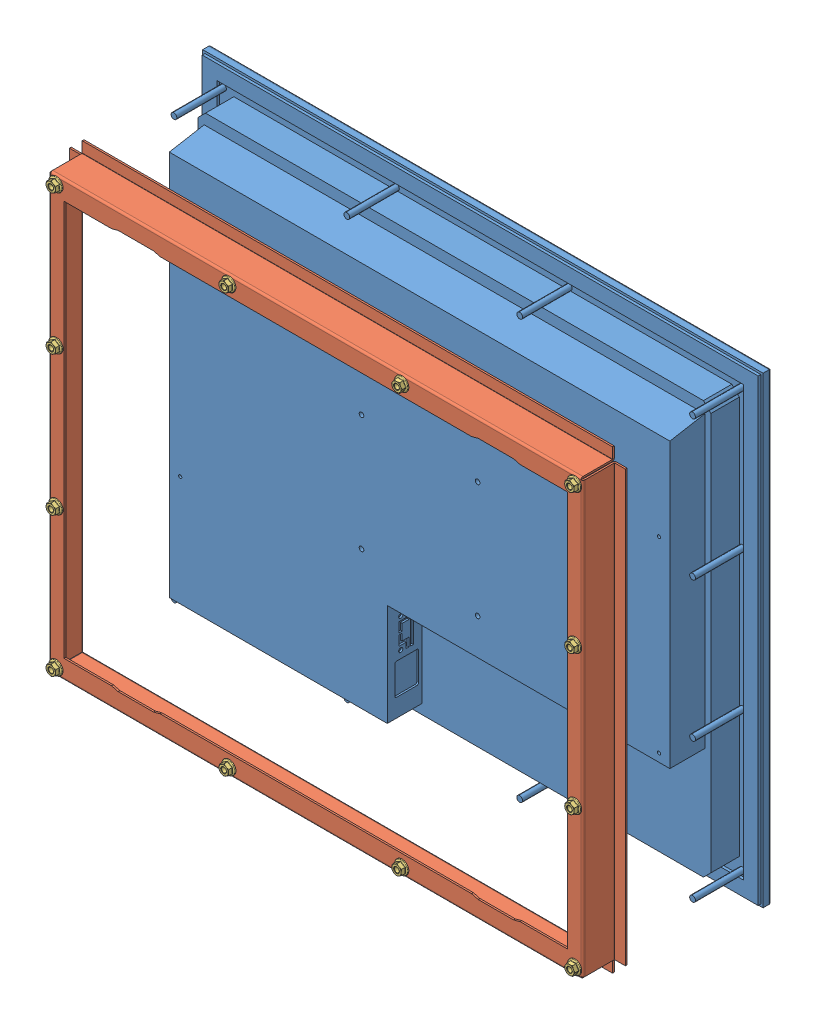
SolidWorks assembly 20 inch Panel Mount Monitor, HIS-ML20-xxxC.SLDASM, configuration Default (file format 10000). Lengths in mm.
Overall size (482.6 398.78 155.92).
14 component instances, 3 part files, 26 mates.
Components (placement in the parent):
- Monitor, 20C-1: Monitor, 20C.sldprt [Default] at origin size (482.6 398.78 61.59)
- Collar, 10740-1: Collar, 10740.sldprt [Default] at (-0.0048 0.0067 142.294) size (478.8 392.57 28.65)
- M5 Nut, 30008-1: M5 Nut, 30008.sldprt [M5 Nut - 30008] at (-223.3259 180.213 148.813) size (11.8 11.8 5)
- M5 Nut, 30008-2: M5 Nut, 30008.sldprt [M5 Nut - 30008] at (-74.4311 180.213 148.813) size (11.8 11.8 5)
- M5 Nut, 30008-3: M5 Nut, 30008.sldprt [M5 Nut - 30008] at (74.4637 180.213 148.813) x (0 -1 0) z (0 0 1) size (11.8 11.8 5)
- M5 Nut, 30008-4: M5 Nut, 30008.sldprt [M5 Nut - 30008] at (223.3168 180.213 148.813) size (11.8 11.8 5)
- M5 Nut, 30008-5: M5 Nut, 30008.sldprt [M5 Nut - 30008] at (223.3278 60.0754 148.813) size (11.8 11.8 5)
- M5 Nut, 30008-6: M5 Nut, 30008.sldprt [M5 Nut - 30008] at (223.3387 -60.0621 148.813) size (11.8 11.8 5)
- M5 Nut, 30008-7: M5 Nut, 30008.sldprt [M5 Nut - 30008] at (223.3497 -180.1997 148.813) x (0 -1 0) z (0 0 1) size (11.8 11.8 5)
- M5 Nut, 30008-8: M5 Nut, 30008.sldprt [M5 Nut - 30008] at (74.4637 -180.1997 148.813) size (11.8 11.8 5)
- M5 Nut, 30008-9: M5 Nut, 30008.sldprt [M5 Nut - 30008] at (-74.4311 -180.1997 148.813) size (11.8 11.8 5)
- M5 Nut, 30008-10: M5 Nut, 30008.sldprt [M5 Nut - 30008] at (-223.3259 -180.1997 148.813) size (11.8 11.8 5)
- M5 Nut, 30008-11: M5 Nut, 30008.sldprt [M5 Nut - 30008] at (-223.315 -60.0621 148.813) size (11.8 11.8 5)
- M5 Nut, 30008-12: M5 Nut, 30008.sldprt [M5 Nut - 30008] at (-223.304 60.0754 148.813) size (11.8 11.8 5)
Mates (geometry in assembly coordinates):
- Concentric1: concentric anti-aligned: cylinder of Monitor, 20C-1 through (223.3168 180.213 42.7) axis (0 0 -1) radius 2.5; cylinder of Collar, 10740-1 through (223.3168 180.213 143.813) axis (0 0 1) radius 3.175
- Parallel1: parallel anti-aligned: line of Monitor, 20C-1 through (482.6 241.3 199.39) axis (0 -1 0); line of Collar, 10740-1 through (-228.3533 196.2912 116.6807) axis (1 0 0)
- Concentric21: concentric: cylinder of Collar, 10740-1 through (-223.3259 180.213 143.813) axis (0 0 1) radius 3.175; cylinder of M5 Nut, 30008-1 through (-230.9946 167.765 111.5699) axis (0 0 1) radius 2.5
- Coincident11: coincident: plane of Collar, 10740-1 through (-0.0048 0.0067 143.813) normal (0 0 1); plane of M5 Nut, 30008-1 through (-230.9946 172.3838 131.6074) normal (0 0 -1)
- Concentric31: concentric: cylinder of Collar, 10740-1 through (-74.4311 180.213 143.813) axis (0 0 1) radius 3.175; cylinder of M5 Nut, 30008-2 through (-134.0497 118.2029 64.179) axis (0 0 1) radius 2.5
- Coincident21: coincident: plane of Collar, 10740-1 through (-0.0048 0.0067 143.813) normal (0 0 1); plane of M5 Nut, 30008-2 through (-134.0497 122.8217 84.2165) normal (0 0 -1)
- Concentric41: concentric: cylinder of Collar, 10740-1 through (74.4637 180.213 143.813) axis (0 0 1) radius 3.175; cylinder of M5 Nut, 30008-3 through (-34.0698 69.2157 13.1783) axis (0 0 1) radius 2.5
- Coincident31: coincident: plane of Collar, 10740-1 through (-0.0048 0.0067 143.813) normal (0 0 1); plane of M5 Nut, 30008-3 through (-29.451 69.2157 33.2158) normal (0 0 -1)
- Concentric51: concentric: cylinder of Collar, 10740-1 through (223.3168 180.213 143.813) axis (0 0 1) radius 3.175; cylinder of M5 Nut, 30008-4 through (65.3787 18.988 -36.0507) axis (0 0 1) radius 2.5
- Coincident41: coincident: plane of Collar, 10740-1 through (-0.0048 0.0067 143.813) normal (0 0 1); plane of M5 Nut, 30008-4 through (65.3787 23.6069 -16.0132) normal (0 0 -1)
- Concentric61: concentric: cylinder of Collar, 10740-1 through (223.3278 60.0754 143.813) axis (0 0 1) radius 3.175; cylinder of M5 Nut, 30008-5 through (104.0226 -60.16 4.4406) axis (0 0 1) radius 2.5
- Coincident51: coincident: plane of Collar, 10740-1 through (-0.0048 0.0067 143.813) normal (0 0 1); plane of M5 Nut, 30008-5 through (104.0226 -55.5412 24.4781) normal (0 0 -1)
- Concentric71: concentric: cylinder of Collar, 10740-1 through (223.3387 -60.0621 143.813) axis (0 0 1) radius 3.175; cylinder of M5 Nut, 30008-6 through (144.4934 -139.8634 43.6603) axis (0 0 1) radius 2.5
- Coincident61: coincident: plane of Collar, 10740-1 through (-0.0048 0.0067 143.813) normal (0 0 1); plane of M5 Nut, 30008-6 through (144.4934 -135.2446 63.6978) normal (0 0 -1)
- Concentric81: concentric: cylinder of Collar, 10740-1 through (223.3497 -180.1997 143.813) axis (0 0 1) radius 3.175; cylinder of M5 Nut, 30008-7 through (182.9165 -216.0826 81.444) axis (0 0 1) radius 2.5
- Coincident71: coincident: plane of Collar, 10740-1 through (-0.0048 0.0067 143.813) normal (0 0 1); plane of M5 Nut, 30008-7 through (187.5353 -216.0826 101.4815) normal (0 0 -1)
- Concentric91: concentric: cylinder of Collar, 10740-1 through (74.4637 -180.1997 143.813) axis (0 0 1) radius 3.175; cylinder of M5 Nut, 30008-8 through (87.8868 -170.8167 131.2151) axis (0 0 1) radius 2.5
- Coincident81: coincident: plane of Collar, 10740-1 through (-0.0048 0.0067 143.813) normal (0 0 1); plane of M5 Nut, 30008-8 through (87.8868 -166.1979 151.2526) normal (0 0 -1)
- Concentric101: concentric: cylinder of Collar, 10740-1 through (-74.4311 -180.1997 143.813) axis (0 0 1) radius 3.175; cylinder of M5 Nut, 30008-9 through (-16.5757 -117.262 182.1316) axis (0 0 1) radius 2.5
- Coincident91: coincident: plane of Collar, 10740-1 through (-0.0048 0.0067 143.813) normal (0 0 1); plane of M5 Nut, 30008-9 through (-16.5757 -112.6432 202.1692) normal (0 0 -1)
- Concentric111: concentric: cylinder of Collar, 10740-1 through (-223.3259 -180.1997 143.813) axis (0 0 1) radius 3.175; cylinder of M5 Nut, 30008-10 through (-112.0019 -72.005 277.3832) axis (0 0 -1) radius 2.5
- Coincident101: coincident: plane of Collar, 10740-1 through (-0.0048 0.0067 143.813) normal (0 0 1); plane of M5 Nut, 30008-10 through (-110.2326 -76.2715 257.3457) normal (0 0 1)
- Concentric121: concentric: cylinder of Collar, 10740-1 through (-223.315 -60.0621 143.813) axis (0 0 1) radius 3.175; cylinder of M5 Nut, 30008-11 through (-150.7847 7.949 191.15) axis (0 0 1) radius 2.5
- Coincident111: coincident: plane of Collar, 10740-1 through (-0.0048 0.0067 143.813) normal (0 0 1); plane of M5 Nut, 30008-11 through (-150.7847 12.5678 211.1875) normal (0 0 -1)
- Concentric131: concentric: cylinder of Collar, 10740-1 through (-223.304 60.0754 143.813) axis (0 0 1) radius 3.175; cylinder of M5 Nut, 30008-12 through (-192.8082 88.9222 197.2885) axis (0 0 -1) radius 2.5
- Coincident121: coincident: plane of Collar, 10740-1 through (-0.0048 0.0067 143.813) normal (0 0 1); plane of M5 Nut, 30008-12 through (-191.039 84.6557 177.2509) normal (0 0 1)
